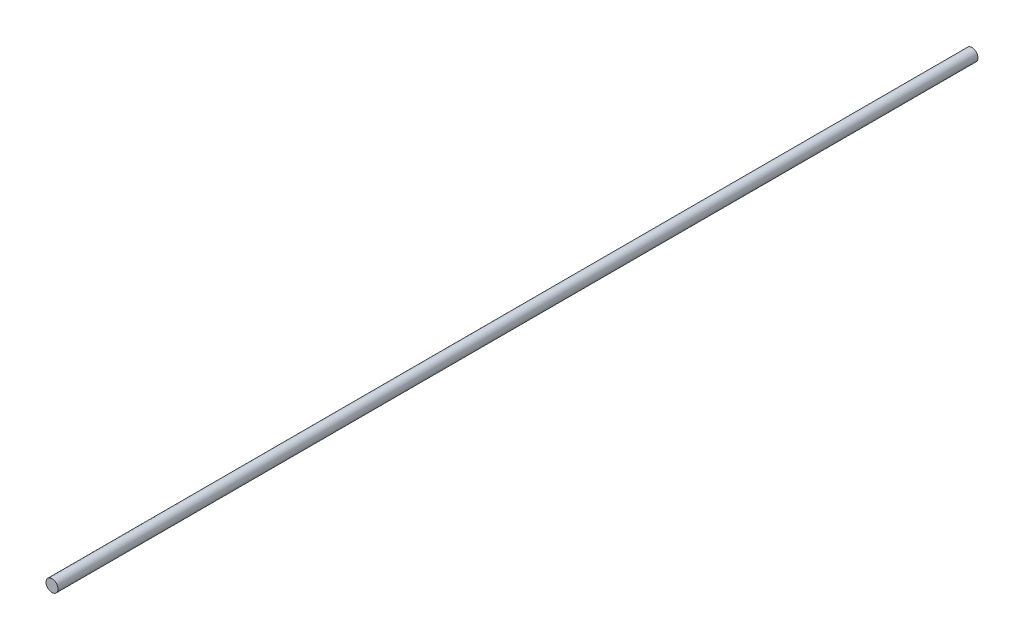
from build123d import *

# Parameters (mm, degrees)
SKETCH1_R           = 30
BOSS_EXTRUDE1_DEPTH = 4600


with BuildPart() as part:
    # Sketch1 → Boss-Extrude1 (new body)
    with BuildSketch(Plane.XY):
        Circle(SKETCH1_R)
    extrude(amount=-BOSS_EXTRUDE1_DEPTH)


solid = part.part
